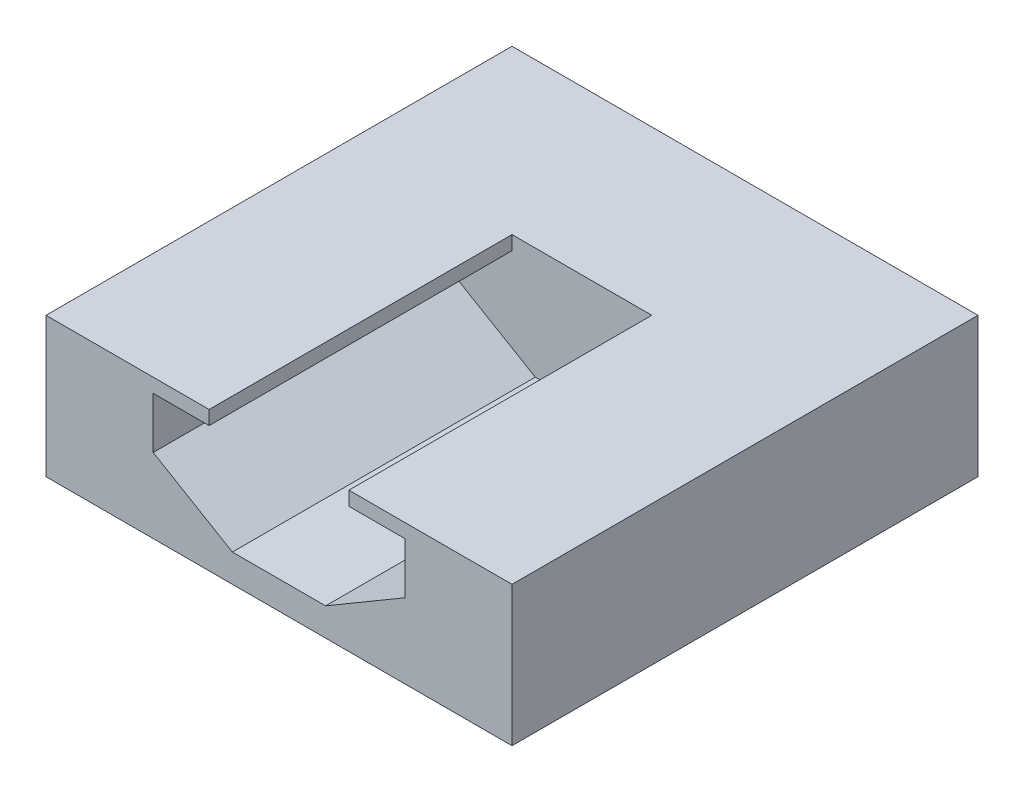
from build123d import *

# Parameters (mm, degrees)
SKETCH1_W           = 50
SKETCH1_H           = 50
BOSS_EXTRUDE1_DEPTH = 15
CUT_EXTRUDE1_DEPTH  = 32.5


with BuildPart() as part:
    # Sketch1 → Boss-Extrude1 (new body)
    with BuildSketch(Plane(origin=(0, 0, 0), x_dir=(1, 0, 0), z_dir=(0, 1, 0))):
        Rectangle(SKETCH1_W, SKETCH1_H)
    extrude(amount=BOSS_EXTRUDE1_DEPTH)

    # Sketch3 → Cut-Extrude1 (cut)
    with BuildSketch(Plane.XY.offset(25)):
        Polygon((-13.498487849, 13.5), (-13.498487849, 8), (-5, 3), (0, 3), (5, 3), (13.498487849, 8), (13.498487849, 13.5), (7.5, 13.5), (7.5, 15), (-7.5, 15), (-7.5, 13.5), align=None)
    extrude(amount=-CUT_EXTRUDE1_DEPTH, mode=Mode.SUBTRACT)


solid = part.part
